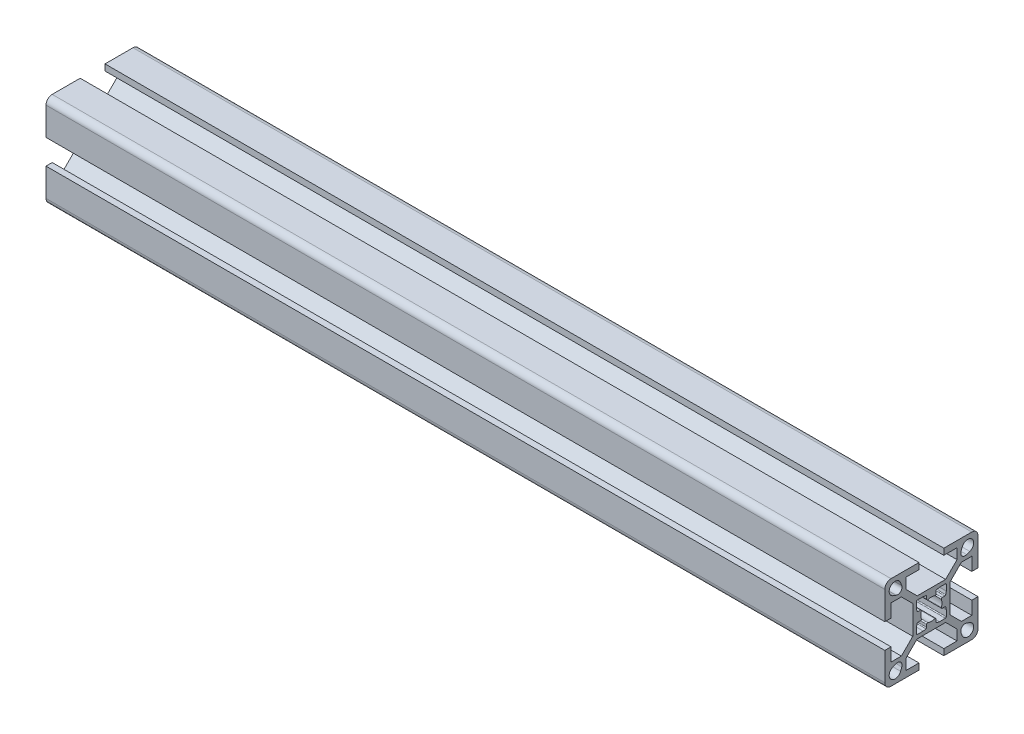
from build123d import *

# Parameters (mm, degrees)
BOSS_EXTRUDE1_DEPTH = 270


with BuildPart() as part:
    # Sketch1 → Boss-Extrude1 (new body)
    with BuildSketch(Plane(origin=(0, 0, 0), x_dir=(0, 0, -1), z_dir=(1, 0, 0))):
        with BuildLine():
            Line((-15, 13), (-15, 4))
            Line((-15, 4), (-13, 4))
            Line((-13, 4), (-13, 8.25))
            Line((-13, 8.25), (-9.664213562, 8.25))
            Line((-9.664213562, 8.25), (-6, 4.585786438))
            Line((-6, 4.585786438), (-6, -4.585786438))
            Line((-6, -4.585786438), (-9.664213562, -8.25))
            Line((-9.664213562, -8.25), (-13, -8.25))
            Line((-13, -8.25), (-13, -4))
            Line((-13, -4), (-15, -4))
            Line((-15, -4), (-15, -13))
            ThreePointArc((-15, -13), (-14.414213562, -14.414213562), (-13, -15))
            Line((-13, -15), (-4, -15))
            Line((-4, -15), (-4, -13))
            Line((-4, -13), (-8.25, -13))
            Line((-8.25, -13), (-8.25, -9.664213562))
            Line((-8.25, -9.664213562), (-4.585786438, -6))
            Line((-4.585786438, -6), (4.585786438, -6))
            Line((4.585786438, -6), (8.25, -9.664213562))
            Line((8.25, -9.664213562), (8.25, -13))
            Line((8.25, -13), (4, -13))
            Line((4, -13), (4, -15))
            Line((4, -15), (13, -15))
            ThreePointArc((13, -15), (14.414213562, -14.414213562), (15, -13))
            Line((15, -13), (15, -4))
            Line((15, -4), (13, -4))
            Line((13, -4), (13, -8.25))
            Line((13, -8.25), (9.664213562, -8.25))
            Line((9.664213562, -8.25), (6, -4.585786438))
            Line((6, -4.585786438), (6, 4.585786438))
            Line((6, 4.585786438), (9.664213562, 8.25))
            Line((9.664213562, 8.25), (13, 8.25))
            Line((13, 8.25), (13, 4))
            Line((13, 4), (15, 4))
            Line((15, 4), (15, 13))
            ThreePointArc((15, 13), (14.414213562, 14.414213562), (13, 15))
            Line((13, 15), (4, 15))
            Line((4, 15), (4, 13))
            Line((4, 13), (8.25, 13))
            Line((8.25, 13), (8.25, 9.664213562))
            Line((8.25, 9.664213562), (4.585786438, 6))
            Line((4.585786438, 6), (-4.585786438, 6))
            Line((-4.585786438, 6), (-8.25, 9.664213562))
            Line((-8.25, 9.664213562), (-8.25, 13))
            Line((-8.25, 13), (-4, 13))
            Line((-4, 13), (-4, 15))
            Line((-4, 15), (-13, 15))
            ThreePointArc((-13, 15), (-14.414213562, 14.414213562), (-15, 13))
        make_face()
        with BuildLine():
            Line((-9.539070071, 11.338915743), (-9.918883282, 12.361530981))
            ThreePointArc((-9.918883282, 12.361530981), (-13.043502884, 13.043502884), (-12.361530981, 9.918883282))
            Line((-12.361530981, 9.918883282), (-11.338915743, 9.539070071))
            ThreePointArc((-11.338915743, 9.539070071), (-9.861522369, 9.861522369), (-9.539070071, 11.338915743))
        make_face(mode=Mode.SUBTRACT)
        with BuildLine():
            Line((9.918883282, 12.361530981), (9.539070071, 11.338915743))
            ThreePointArc((9.539070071, 11.338915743), (9.861522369, 9.861522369), (11.338915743, 9.539070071))
            Line((11.338915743, 9.539070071), (12.361530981, 9.918883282))
            ThreePointArc((12.361530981, 9.918883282), (13.043502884, 13.043502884), (9.918883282, 12.361530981))
        make_face(mode=Mode.SUBTRACT)
        with BuildLine():
            Line((12.361530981, -9.918883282), (11.338915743, -9.539070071))
            ThreePointArc((11.338915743, -9.539070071), (9.861522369, -9.861522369), (9.539070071, -11.338915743))
            Line((9.539070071, -11.338915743), (9.918883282, -12.361530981))
            ThreePointArc((9.918883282, -12.361530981), (13.043502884, -13.043502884), (12.361530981, -9.918883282))
        make_face(mode=Mode.SUBTRACT)
        with BuildLine():
            Line((-11.338915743, -9.539070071), (-12.361530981, -9.918883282))
            ThreePointArc((-12.361530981, -9.918883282), (-13.043502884, -13.043502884), (-9.918883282, -12.361530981))
            Line((-9.918883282, -12.361530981), (-9.539070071, -11.338915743))
            ThreePointArc((-9.539070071, -11.338915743), (-9.861522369, -9.861522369), (-11.338915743, -9.539070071))
        make_face(mode=Mode.SUBTRACT)
        with BuildLine():
            Line((-4.8, -2.644433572), (-4.8, -4.5))
            ThreePointArc((-4.8, -4.5), (-4.712132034, -4.712132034), (-4.5, -4.8))
            Line((-4.5, -4.8), (-2.644433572, -4.8))
            ThreePointArc((-2.644433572, -4.8), (-2.615679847, -4.79861886), (-2.587190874, -4.794488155))
            Line((-2.587190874, -4.794488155), (-1.742757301, -4.630346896))
            ThreePointArc((-1.742757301, -4.630346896), (-1.568512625, -4.526682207), (-1.5, -4.335858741))
            Line((-1.5, -4.335858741), (-1.5, -3.5))
            ThreePointArc((-1.5, -3.5), (-1.374371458, -3.255879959), (-1.102702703, -3.216216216))
            ThreePointArc((-1.102702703, -3.216216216), (0, -3.4), (1.102702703, -3.216216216))
            ThreePointArc((1.102702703, -3.216216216), (1.374371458, -3.255879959), (1.5, -3.5))
            Line((1.5, -3.5), (1.5, -4.335858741))
            ThreePointArc((1.5, -4.335858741), (1.568512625, -4.526682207), (1.742757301, -4.630346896))
            Line((1.742757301, -4.630346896), (2.587190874, -4.794488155))
            ThreePointArc((2.587190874, -4.794488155), (2.615679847, -4.79861886), (2.644433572, -4.8))
            Line((2.644433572, -4.8), (4.5, -4.8))
            ThreePointArc((4.5, -4.8), (4.712132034, -4.712132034), (4.8, -4.5))
            Line((4.8, -4.5), (4.8, -2.644433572))
            ThreePointArc((4.8, -2.644433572), (4.79861886, -2.615679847), (4.794488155, -2.587190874))
            Line((4.794488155, -2.587190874), (4.630346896, -1.742757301))
            ThreePointArc((4.630346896, -1.742757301), (4.526682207, -1.568512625), (4.335858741, -1.5))
            Line((4.335858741, -1.5), (3.5, -1.5))
            ThreePointArc((3.5, -1.5), (3.255879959, -1.374371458), (3.216216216, -1.102702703))
            ThreePointArc((3.216216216, -1.102702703), (3.4, 0), (3.216216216, 1.102702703))
            ThreePointArc((3.216216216, 1.102702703), (3.255879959, 1.374371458), (3.5, 1.5))
            Line((3.5, 1.5), (4.335858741, 1.5))
            ThreePointArc((4.335858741, 1.5), (4.526682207, 1.568512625), (4.630346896, 1.742757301))
            Line((4.630346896, 1.742757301), (4.794488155, 2.587190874))
            ThreePointArc((4.794488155, 2.587190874), (4.79861886, 2.615679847), (4.8, 2.644433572))
            Line((4.8, 2.644433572), (4.8, 4.5))
            ThreePointArc((4.8, 4.5), (4.712132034, 4.712132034), (4.5, 4.8))
            Line((4.5, 4.8), (2.644433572, 4.8))
            ThreePointArc((2.644433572, 4.8), (2.615679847, 4.79861886), (2.587190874, 4.794488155))
            Line((2.587190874, 4.794488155), (1.742757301, 4.630346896))
            ThreePointArc((1.742757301, 4.630346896), (1.568512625, 4.526682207), (1.5, 4.335858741))
            Line((1.5, 4.335858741), (1.5, 3.5))
            ThreePointArc((1.5, 3.5), (1.374371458, 3.255879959), (1.102702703, 3.216216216))
            ThreePointArc((1.102702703, 3.216216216), (0, 3.4), (-1.102702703, 3.216216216))
            ThreePointArc((-1.102702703, 3.216216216), (-1.374371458, 3.255879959), (-1.5, 3.5))
            Line((-1.5, 3.5), (-1.5, 4.335858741))
            ThreePointArc((-1.5, 4.335858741), (-1.568512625, 4.526682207), (-1.742757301, 4.630346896))
            Line((-1.742757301, 4.630346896), (-2.587190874, 4.794488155))
            ThreePointArc((-2.587190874, 4.794488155), (-2.615679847, 4.79861886), (-2.644433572, 4.8))
            Line((-2.644433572, 4.8), (-4.5, 4.8))
            ThreePointArc((-4.5, 4.8), (-4.712132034, 4.712132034), (-4.8, 4.5))
            Line((-4.8, 4.5), (-4.8, 2.644433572))
            ThreePointArc((-4.8, 2.644433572), (-4.79861886, 2.615679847), (-4.794488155, 2.587190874))
            Line((-4.794488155, 2.587190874), (-4.630346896, 1.742757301))
            ThreePointArc((-4.630346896, 1.742757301), (-4.526682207, 1.568512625), (-4.335858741, 1.5))
            Line((-4.335858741, 1.5), (-3.5, 1.5))
            ThreePointArc((-3.5, 1.5), (-3.255879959, 1.374371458), (-3.216216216, 1.102702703))
            ThreePointArc((-3.216216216, 1.102702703), (-3.4, 0), (-3.216216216, -1.102702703))
            ThreePointArc((-3.216216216, -1.102702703), (-3.255879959, -1.374371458), (-3.5, -1.5))
            Line((-3.5, -1.5), (-4.335858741, -1.5))
            ThreePointArc((-4.335858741, -1.5), (-4.526682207, -1.568512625), (-4.630346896, -1.742757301))
            Line((-4.630346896, -1.742757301), (-4.794488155, -2.587190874))
            ThreePointArc((-4.794488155, -2.587190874), (-4.79861886, -2.615679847), (-4.8, -2.644433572))
        make_face(mode=Mode.SUBTRACT)
    extrude(amount=BOSS_EXTRUDE1_DEPTH)


solid = part.part
